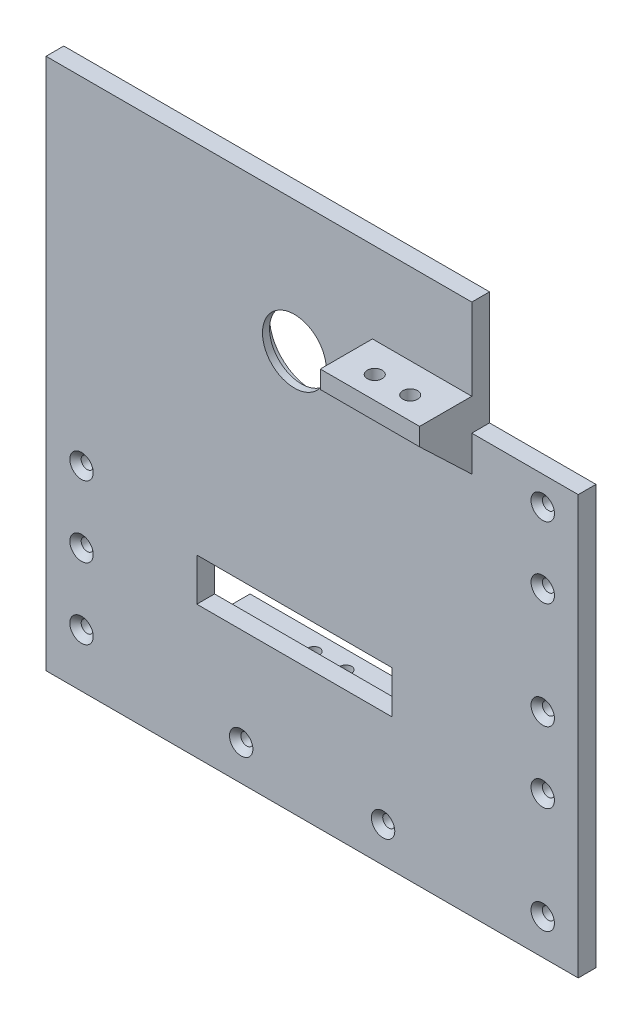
from build123d import *

# Parameters (mm, degrees)
SKETCH_1_W                   = 150
SKETCH_1_H                   = 150
EXTRUDE_1_DEPTH              = 5
SKETCH_2_W                   = 30
SKETCH_2_H                   = 32
CUT_EXTRUDE_1_DEPTH          = 5
SKETCH_3_R                   = 9
CUT_EXTRUDE_2_DEPTH          = 5
HOLE_WIZARD_M3_1_D           = 3.4
HOLE_WIZARD_M3_1_DEPTH       = 7
HOLE_WIZARD_M3_1_CSINK_D     = 6.6
HOLE_WIZARD_M3_1_CSINK_ANGLE = 90
HOLE_WIZARD_M3_1_TIP         = 1.021463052
SKETCH_6_R                   = 12.05
CUT_EXTRUDE_3_DEPTH          = 3
SKETCH_7_W                   = 28
SKETCH_7_H                   = 5
EXTRUDE_2_DEPTH              = 14.7
HOLE_WIZARD_M5_1_D           = 4.2
HOLE_WIZARD_M5_1_DEPTH       = 14
HOLE_WIZARD_M5_1_TIP         = 1.2618073
SKETCH_12_W                  = 55
SKETCH_12_H                  = 5
EXTRUDE_5_DEPTH              = 10
EXTRUDE_6_DEPTH              = 5
EXTRUDE_7_DEPTH              = 5
SKETCH_16_W                  = 55
SKETCH_16_H                  = 12
CUT_EXTRUDE_4_DEPTH          = 10
HOLE_WIZARD_M4_1_D           = 3.3
HOLE_WIZARD_M4_1_DEPTH       = 11.5
HOLE_WIZARD_M4_1_TIP         = 0.991420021
EXTRUDE_8_DEPTH              = 4
EXTRUDE_9_DEPTH              = 4
SKETCH_21_W                  = 28
SKETCH_21_H                  = 5
EXTRUDE_10_DEPTH             = 14.7
EXTRUDE_11_DEPTH             = 4
EXTRUDE_12_DEPTH             = 4
HOLE_WIZARD_M5_2_D           = 4.2
SKETCH_26_W                  = 41.672036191
SKETCH_26_H                  = 25.46624434
CUT_EXTRUDE_5_DEPTH          = 14.7


with BuildPart() as part:
    # Sketch 1 → Extrude 1 (new body)
    with BuildSketch(Plane.XY):
        Rectangle(SKETCH_1_W, SKETCH_1_H)
    extrude(amount=EXTRUDE_1_DEPTH)

    # Sketch 2 → Cut-Extrude 1 (cut)
    with BuildSketch(Plane.XY.offset(5)):
        with Locations((60, 59)):
            Rectangle(SKETCH_2_W, SKETCH_2_H)
    extrude(amount=-CUT_EXTRUDE_1_DEPTH, mode=Mode.SUBTRACT)

    # Sketch 3 → Cut-Extrude 2 (cut)
    with BuildSketch(Plane.XY.offset(5)):
        with Locations((-5, 38)):
            Circle(SKETCH_3_R)
    extrude(amount=-CUT_EXTRUDE_2_DEPTH, mode=Mode.SUBTRACT)

    # Hole Wizard M3 _1
    with Locations(Plane.XY.offset(5)):
        with Locations((65, 35), (65, 15), (65, -15), (65, -35), (65, -65), (20, -65), (-20, -65), (-65, -60), (-65, -40), (-65, -20)):
            CounterSinkHole(HOLE_WIZARD_M3_1_D / 2, HOLE_WIZARD_M3_1_CSINK_D / 2, depth=HOLE_WIZARD_M3_1_DEPTH, counter_sink_angle=HOLE_WIZARD_M3_1_CSINK_ANGLE)
            with Locations((0, 0, -(HOLE_WIZARD_M3_1_DEPTH + HOLE_WIZARD_M3_1_TIP / 2))):  # 118° drill point
                Cone(0, HOLE_WIZARD_M3_1_D / 2, HOLE_WIZARD_M3_1_TIP, mode=Mode.SUBTRACT)

    # Sketch 6 → Cut-Extrude 3 (cut)
    with BuildSketch(Plane(origin=(0, 0, 0), x_dir=(-1, 0, 0), z_dir=(0, 0, -1))):
        with Locations((5, 38)):
            Circle(SKETCH_6_R)
    extrude(amount=-CUT_EXTRUDE_3_DEPTH, mode=Mode.SUBTRACT)

    # Sketch 7 → Extrude 2 (add)
    with BuildSketch(Plane(origin=(0, 0, 0), x_dir=(-1, 0, 0), z_dir=(0, 0, -1))):
        with Locations((-31, 49.5)):
            Rectangle(SKETCH_7_W, SKETCH_7_H)
    extrude(amount=EXTRUDE_2_DEPTH)

    # Hole Wizard M5 _1
    with Locations(Plane(origin=(0, 52, 0), x_dir=(1, 0, 0), z_dir=(0, 1, 0))):
        with Locations((26, 8.35), (36, 8.35)):
            Hole(HOLE_WIZARD_M5_1_D / 2, depth=HOLE_WIZARD_M5_1_DEPTH)
            with Locations((0, 0, -(HOLE_WIZARD_M5_1_DEPTH + HOLE_WIZARD_M5_1_TIP / 2))):  # 118° drill point
                Cone(0, HOLE_WIZARD_M5_1_D / 2, HOLE_WIZARD_M5_1_TIP, mode=Mode.SUBTRACT)

    # Sketch 12 → Extrude 5 (add)
    with BuildSketch(Plane(origin=(0, 0, 0), x_dir=(-1, 0, 0), z_dir=(0, 0, -1))):
        with Locations((5, -45)):
            Rectangle(SKETCH_12_W, SKETCH_12_H)
    extrude(amount=EXTRUDE_5_DEPTH)

    # Sketch 14 → Extrude 6 (add)
    with BuildSketch(Plane(origin=(22.5, 0, 0), x_dir=(0, 0, -1), z_dir=(1, 0, 0))):
        Polygon((10, -47.5), (0, -57.5), (0, -47.5), align=None)
    extrude(amount=-EXTRUDE_6_DEPTH)

    # Sketch 15 → Extrude 7 (add)
    with BuildSketch(Plane.ZY.offset(32.5)):
        Polygon((-10, -47.5), (0, -57.5), (0, -47.5), align=None)
    extrude(amount=-EXTRUDE_7_DEPTH)

    # Sketch 16 → Cut-Extrude 4 (cut)
    with BuildSketch(Plane(origin=(0, 0, 0), x_dir=(-1, 0, 0), z_dir=(0, 0, -1))):
        with Locations((5, -31.5)):
            Rectangle(SKETCH_16_W, SKETCH_16_H)
    extrude(amount=-CUT_EXTRUDE_4_DEPTH, mode=Mode.SUBTRACT)

    # Hole Wizard M4 _1
    with Locations(Plane(origin=(0, -42.5, 0), x_dir=(1, 0, 0), z_dir=(0, 1, 0))):
        with Locations((-9.5, 5), (-0.5, 5)):
            Hole(HOLE_WIZARD_M4_1_D / 2, depth=HOLE_WIZARD_M4_1_DEPTH)
            with Locations((0, 0, -(HOLE_WIZARD_M4_1_DEPTH + HOLE_WIZARD_M4_1_TIP / 2))):  # 118° drill point
                Cone(0, HOLE_WIZARD_M4_1_D / 2, HOLE_WIZARD_M4_1_TIP, mode=Mode.SUBTRACT)

    # Sketch 19 → Extrude 8 (add)
    with BuildSketch(Plane(origin=(45, 0, 0), x_dir=(0, 0, -1), z_dir=(1, 0, 0))):
        Polygon((0, 47), (0, 33), (14.7, 47), align=None)
    extrude(amount=-EXTRUDE_8_DEPTH)

    # Sketch 20 → Extrude 9 (add)
    with BuildSketch(Plane.ZY.offset(-17)):
        Polygon((-14.7, 47), (0, 33), (0, 47), align=None)
    extrude(amount=-EXTRUDE_9_DEPTH)

    # Sketch 21 → Extrude 10 (add)
    with BuildSketch(Plane.XY.offset(5)):
        with Locations((31, 49.5)):
            Rectangle(SKETCH_21_W, SKETCH_21_H)
    extrude(amount=EXTRUDE_10_DEPTH)

    # Sketch 22 → Extrude 11 (add)
    with BuildSketch(Plane.ZY.offset(-17)):
        Polygon((5, 47), (19.7, 47), (5, 33), align=None)
    extrude(amount=-EXTRUDE_11_DEPTH)

    # Sketch 23 → Extrude 12 (add)
    with BuildSketch(Plane(origin=(45, 0, 0), x_dir=(0, 0, -1), z_dir=(1, 0, 0))):
        Polygon((-19.7, 47), (-5, 33), (-5, 47), align=None)
    extrude(amount=-EXTRUDE_12_DEPTH)

    # Hole Wizard M5 _2 (through all)
    with Locations(Plane(origin=(0, 52, 0), x_dir=(1, 0, 0), z_dir=(0, 1, 0))):
        with Locations((26, -13.35), (36, -13.35)):
            Hole(HOLE_WIZARD_M5_2_D / 2)

    # Sketch 26 → Cut-Extrude 5 (cut)
    with BuildSketch(Plane(origin=(0, 0, -14.7), x_dir=(-1, 0, 0), z_dir=(0, 0, -1))):
        with Locations((-32.266889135, 43.553065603)):
            Rectangle(SKETCH_26_W, SKETCH_26_H)
    extrude(amount=-CUT_EXTRUDE_5_DEPTH, mode=Mode.SUBTRACT)


solid = part.part
